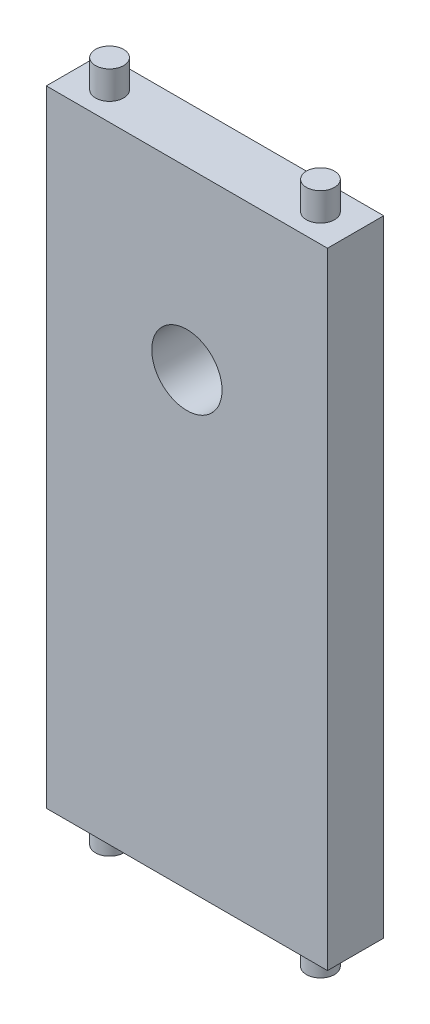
from build123d import *

# Parameters (mm, degrees)
SKETCH1_W           = 20
SKETCH1_H           = 44.5
SKETCH1_R           = 2.5
BOSS_EXTRUDE1_DEPTH = 4
SKETCH2_R           = 1
BOSS_EXTRUDE2_DEPTH = 2


with BuildPart() as part:
    # Sketch1 → Boss-Extrude1 (new body)
    with BuildSketch(Plane.XY):
        Rectangle(SKETCH1_W, SKETCH1_H)
        with Locations((0, 9.75)):
            Circle(SKETCH1_R, mode=Mode.SUBTRACT)
    extrude(amount=BOSS_EXTRUDE1_DEPTH)

    # Sketch2 → Boss-Extrude2 (add)
    with BuildSketch(Plane(origin=(0, 22.25, 0), x_dir=(1, 0, 0), z_dir=(0, 1, 0))):
        with Locations(Location((-7.5, -2, 0), (0, 0, 90))):
            Circle(SKETCH2_R)
        with Locations(Location((7.5, -2, 0), (0, 0, 90))):
            Circle(SKETCH2_R)
    boss_extrude2 = extrude(amount=BOSS_EXTRUDE2_DEPTH)

    # Mirror1: Boss-Extrude2 across plane
    add(boss_extrude2.mirror(Plane.ZX))


solid = part.part
